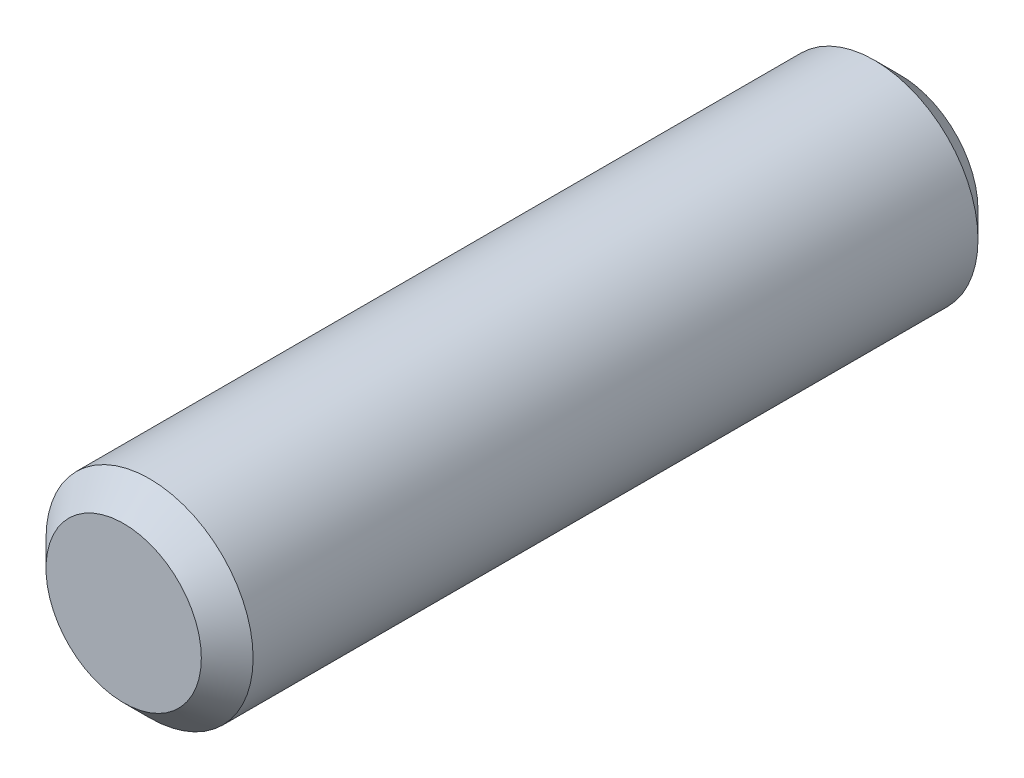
from build123d import *

# Parameters (mm, degrees)
ESQUISSE1_R      = 2
EXTRUSION1_DEPTH = 7.5
CHANFREIN1_SIZE  = 0.5


with BuildPart() as part:
    # Esquisse1 → Extrusion1 (new, symmetric)
    with BuildSketch(Plane.XY):
        Circle(ESQUISSE1_R)
    extrude(amount=EXTRUSION1_DEPTH, both=True)

    # Chanfrein1
    chanfrein1_edges = [part.edges().sort_by_distance(p)[0] for p in [
        (-2, 0, -7.5),
        (-2, 0, 7.5),
    ]]
    chamfer(chanfrein1_edges, length=CHANFREIN1_SIZE)


solid = part.part
